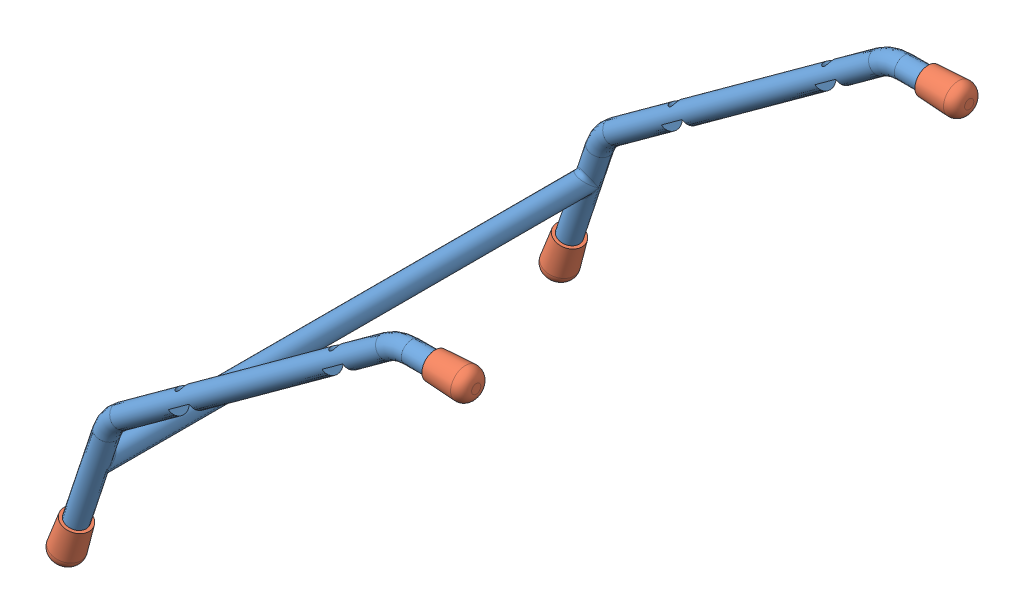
SolidWorks assembly Stand.SLDASM, configuration Default (file format 3100). Lengths in mm.
Overall size (133.38 117.14 164.23).
5 component instances, 2 part files, 8 mates.
Components (placement in the parent):
- Stand-1: Stand.sldprt [Default] at (0.71 0 65.3213) size (122.22 106.95 158.75)
- Boot-1: Boot.sldprt [Default] at (-120.4857 -108.8048 65.3213) x (0.852953 -0.281779 -0.439399) z (0.417221 -0.137832 0.898292) size (9.18 12.7 9.18)
- Boot-2: Boot.sldprt [Default] at (-120.4857 -108.8048 -87.0787) x (0.930407 -0.307367 0.199673) z (-0.189595 0.062634 0.979863) size (9.18 12.7 9.18)
- Boot-3: Boot.sldprt [Default] at (7.06 0 65.3213) x (0 0.584849 -0.811142) z (0 0.811142 0.584849) size (9.18 12.7 9.18)
- Boot-4: Boot.sldprt [Default] at (7.06 0 -87.0787) x (0 -0.98196 0.189089) z (0 -0.189089 -0.98196) size (9.18 12.7 9.18)
Mates (geometry in assembly coordinates):
- Concentric1: concentric anti-aligned: cylinder of Stand-1; cylinder of Boot-4
- Coincident1: coincident anti-aligned: plane of Stand-1; plane of Boot-4
- Concentric2: concentric anti-aligned: cylinder of Stand-1; cylinder of Boot-2
- Coincident2: coincident anti-aligned: plane of Stand-1; plane of Boot-2
- Concentric3: concentric anti-aligned: cylinder of Stand-1; cylinder of Boot-3
- Coincident3: coincident anti-aligned: plane of Stand-1; plane of Boot-3
- Concentric4: concentric anti-aligned: cylinder of Stand-1; cylinder of Boot-1
- Coincident4: coincident anti-aligned: plane of Stand-1; plane of Boot-1
